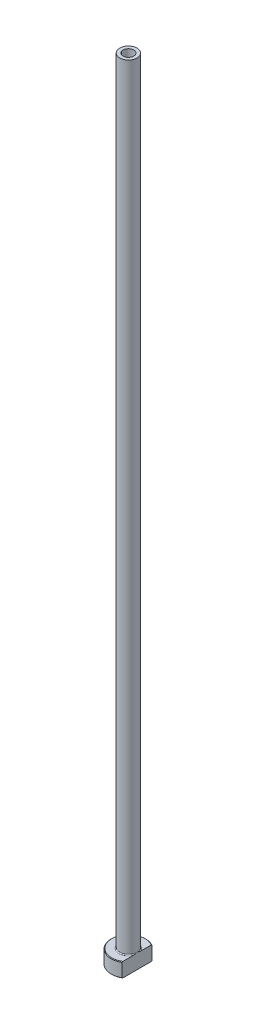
ISO-10303-21;
HEADER;
FILE_DESCRIPTION(('STEP AP214'),'2;1');
FILE_NAME('part.step','',(''),(''),'','','');
FILE_SCHEMA(('AUTOMOTIVE_DESIGN { 1 0 10303 214 1 1 1 1 }'));
ENDSEC;
DATA;
#1=APPLICATION_CONTEXT('core data for automotive mechanical design processes');
#2=APPLICATION_PROTOCOL_DEFINITION('international standard','automotive_design',2000,#1);
#3=PRODUCT_CONTEXT('',#1,'mechanical');
#4=PRODUCT('Part','Part','',(#3));
#5=PRODUCT_RELATED_PRODUCT_CATEGORY('part','',(#4));
#6=PRODUCT_DEFINITION_FORMATION('','',#4);
#7=PRODUCT_DEFINITION_CONTEXT('part definition',#1,'design');
#8=PRODUCT_DEFINITION('design','',#6,#7);
#9=PRODUCT_DEFINITION_SHAPE('','',#8);
#10=(LENGTH_UNIT() NAMED_UNIT(*) SI_UNIT(.MILLI.,.METRE.));
#11=(NAMED_UNIT(*) PLANE_ANGLE_UNIT() SI_UNIT($,.RADIAN.));
#12=(NAMED_UNIT(*) SI_UNIT($,.STERADIAN.) SOLID_ANGLE_UNIT());
#13=UNCERTAINTY_MEASURE_WITH_UNIT(LENGTH_MEASURE(1.E-05),#10,'distance_accuracy_value','');
#14=(GEOMETRIC_REPRESENTATION_CONTEXT(3) GLOBAL_UNCERTAINTY_ASSIGNED_CONTEXT((#13)) GLOBAL_UNIT_ASSIGNED_CONTEXT((#10,
#11,#12)) REPRESENTATION_CONTEXT('',''));
#15=CARTESIAN_POINT('',(0.,0.,0.));
#16=DIRECTION('',(0.,0.,1.));
#17=DIRECTION('',(1.,0.,0.));
#18=AXIS2_PLACEMENT_3D('',#15,#16,#17);
#19=CARTESIAN_POINT('',(0.,92.1876809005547,0.));
#20=DIRECTION('',(0.,1.,0.));
#21=DIRECTION('',(0.,0.,1.));
#22=AXIS2_PLACEMENT_3D('',#19,#20,#21);
#23=CYLINDRICAL_SURFACE('',#22,1.85000000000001);
#24=CARTESIAN_POINT('',(0.,275.,0.));
#25=DIRECTION('',(0.,1.,0.));
#26=DIRECTION('',(0.,0.,1.));
#27=AXIS2_PLACEMENT_3D('',#24,#25,#26);
#28=CIRCLE('',#27,1.85000000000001);
#29=CARTESIAN_POINT('',(0.,275.,1.85000000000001));
#30=VERTEX_POINT('',#29);
#31=EDGE_CURVE('E167',#30,#30,#28,.T.);
#32=ORIENTED_EDGE('',*,*,#31,.T.);
#33=EDGE_LOOP('',(#32));
#34=FACE_BOUND('',#33,.T.);
#35=CARTESIAN_POINT('',(0.,230.,0.));
#36=DIRECTION('',(0.,1.,0.));
#37=DIRECTION('',(0.,0.,1.));
#38=AXIS2_PLACEMENT_3D('',#35,#36,#37);
#39=CIRCLE('',#38,1.85000000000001);
#40=CARTESIAN_POINT('',(0.,230.,1.85000000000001));
#41=VERTEX_POINT('',#40);
#42=EDGE_CURVE('E170',#41,#41,#39,.T.);
#43=ORIENTED_EDGE('',*,*,#42,.F.);
#44=EDGE_LOOP('',(#43));
#45=FACE_BOUND('',#44,.T.);
#46=ADVANCED_FACE('F32',(#34,#45),#23,.F.);
#47=CARTESIAN_POINT('',(-1.85000000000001,275.,0.));
#48=DIRECTION('',(0.,1.,0.));
#49=DIRECTION('',(0.,0.,1.));
#50=AXIS2_PLACEMENT_3D('',#47,#48,#49);
#51=PLANE('',#50);
#52=CARTESIAN_POINT('',(0.,275.,0.));
#53=DIRECTION('',(0.,1.,0.));
#54=DIRECTION('',(0.,0.,1.));
#55=AXIS2_PLACEMENT_3D('',#52,#53,#54);
#56=CIRCLE('',#55,3.00000000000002);
#57=CARTESIAN_POINT('',(0.,275.,3.00000000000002));
#58=VERTEX_POINT('',#57);
#59=EDGE_CURVE('E174',#58,#58,#56,.T.);
#60=ORIENTED_EDGE('',*,*,#59,.T.);
#61=EDGE_LOOP('',(#60));
#62=FACE_BOUND('',#61,.T.);
#63=ORIENTED_EDGE('',*,*,#31,.F.);
#64=EDGE_LOOP('',(#63));
#65=FACE_BOUND('',#64,.T.);
#66=ADVANCED_FACE('F157',(#62,#65),#51,.T.);
#67=CARTESIAN_POINT('',(0.,92.1876809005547,0.));
#68=DIRECTION('',(0.,1.,0.));
#69=DIRECTION('',(0.,0.,1.));
#70=AXIS2_PLACEMENT_3D('',#67,#68,#69);
#71=CYLINDRICAL_SURFACE('',#70,3.00000000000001);
#72=CARTESIAN_POINT('',(0.,5.3,0.));
#73=DIRECTION('',(0.,1.,0.));
#74=DIRECTION('',(0.,0.,1.));
#75=AXIS2_PLACEMENT_3D('',#72,#73,#74);
#76=CIRCLE('',#75,3.00000000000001);
#77=CARTESIAN_POINT('',(3.,5.3,0.));
#78=VERTEX_POINT('',#77);
#79=EDGE_CURVE('E180',#78,#78,#76,.T.);
#80=ORIENTED_EDGE('',*,*,#79,.T.);
#81=EDGE_LOOP('',(#80));
#82=FACE_BOUND('',#81,.T.);
#83=ORIENTED_EDGE('',*,*,#59,.F.);
#84=EDGE_LOOP('',(#83));
#85=FACE_BOUND('',#84,.T.);
#86=ADVANCED_FACE('F162',(#82,#85),#71,.T.);
#87=CARTESIAN_POINT('',(-2.99999999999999,5.,0.));
#88=DIRECTION('',(0.,1.,0.));
#89=DIRECTION('',(0.,0.,1.));
#90=AXIS2_PLACEMENT_3D('',#87,#88,#89);
#91=PLANE('',#90);
#92=DIRECTION('',(0.,0.,1.));
#93=VECTOR('',#92,1.);
#94=CARTESIAN_POINT('',(3.,5.,0.));
#95=LINE('',#94,#93);
#96=CARTESIAN_POINT('',(3.,5.,-4.96386945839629));
#97=VERTEX_POINT('',#96);
#98=CARTESIAN_POINT('',(3.,5.,-1.37477270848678));
#99=VERTEX_POINT('',#98);
#100=EDGE_CURVE('E54',#97,#99,#95,.T.);
#101=ORIENTED_EDGE('',*,*,#100,.F.);
#102=CARTESIAN_POINT('',(0.,5.,0.));
#103=DIRECTION('',(0.,1.,0.));
#104=DIRECTION('',(0.,0.,1.));
#105=AXIS2_PLACEMENT_3D('',#102,#103,#104);
#106=CIRCLE('',#105,5.79999999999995);
#107=CARTESIAN_POINT('',(2.99999999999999,5.,4.96386945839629));
#108=VERTEX_POINT('',#107);
#109=EDGE_CURVE('E186',#97,#108,#106,.T.);
#110=ORIENTED_EDGE('',*,*,#109,.T.);
#111=CARTESIAN_POINT('',(3.,5.,1.37477270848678));
#112=VERTEX_POINT('',#111);
#113=EDGE_CURVE('E134',#112,#108,#95,.T.);
#114=ORIENTED_EDGE('',*,*,#113,.F.);
#115=CARTESIAN_POINT('',(0.,5.,0.));
#116=DIRECTION('',(0.,1.,0.));
#117=DIRECTION('',(0.,0.,1.));
#118=AXIS2_PLACEMENT_3D('',#115,#116,#117);
#119=CIRCLE('',#118,3.30000000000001);
#120=EDGE_CURVE('E183',#112,#99,#119,.F.);
#121=ORIENTED_EDGE('',*,*,#120,.T.);
#122=EDGE_LOOP('',(#101,#110,#114,#121));
#123=FACE_BOUND('',#122,.T.);
#124=ADVANCED_FACE('F197',(#123),#91,.T.);
#125=CARTESIAN_POINT('',(0.,92.1876809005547,0.));
#126=DIRECTION('',(0.,1.,0.));
#127=DIRECTION('',(0.,0.,1.));
#128=AXIS2_PLACEMENT_3D('',#125,#126,#127);
#129=CYLINDRICAL_SURFACE('',#128,5.99999999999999);
#130=DIRECTION('',(0.,-1.,0.));
#131=VECTOR('',#130,1.);
#132=CARTESIAN_POINT('',(2.99999999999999,275.,5.19615242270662));
#133=LINE('',#132,#131);
#134=CARTESIAN_POINT('',(2.99999999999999,4.79999999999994,5.19615242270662));
#135=VERTEX_POINT('',#134);
#136=CARTESIAN_POINT('',(2.99999999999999,0.199999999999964,5.19615242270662));
#137=VERTEX_POINT('',#136);
#138=EDGE_CURVE('E82',#135,#137,#133,.T.);
#139=ORIENTED_EDGE('',*,*,#138,.F.);
#140=CARTESIAN_POINT('',(0.,4.79999999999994,0.));
#141=DIRECTION('',(0.,1.,0.));
#142=DIRECTION('',(0.,0.,1.));
#143=AXIS2_PLACEMENT_3D('',#140,#141,#142);
#144=CIRCLE('',#143,5.99999999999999);
#145=CARTESIAN_POINT('',(3.,4.79999999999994,-5.19615242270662));
#146=VERTEX_POINT('',#145);
#147=EDGE_CURVE('E95',#135,#146,#144,.F.);
#148=ORIENTED_EDGE('',*,*,#147,.T.);
#149=DIRECTION('',(0.,-1.,0.));
#150=VECTOR('',#149,1.);
#151=CARTESIAN_POINT('',(3.,275.,-5.19615242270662));
#152=LINE('',#151,#150);
#153=CARTESIAN_POINT('',(3.,0.199999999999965,-5.19615242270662));
#154=VERTEX_POINT('',#153);
#155=EDGE_CURVE('E192',#146,#154,#152,.T.);
#156=ORIENTED_EDGE('',*,*,#155,.T.);
#157=CARTESIAN_POINT('',(0.,0.199999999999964,0.));
#158=DIRECTION('',(0.,-1.,0.));
#159=DIRECTION('',(0.,0.,-1.));
#160=AXIS2_PLACEMENT_3D('',#157,#158,#159);
#161=CIRCLE('',#160,5.99999999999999);
#162=EDGE_CURVE('E98',#154,#137,#161,.F.);
#163=ORIENTED_EDGE('',*,*,#162,.T.);
#164=EDGE_LOOP('',(#139,#148,#156,#163));
#165=FACE_BOUND('',#164,.T.);
#166=ADVANCED_FACE('F190',(#165),#129,.T.);
#167=CARTESIAN_POINT('',(-5.99999999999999,0.,0.));
#168=DIRECTION('',(0.,-1.,0.));
#169=DIRECTION('',(0.,0.,-1.));
#170=AXIS2_PLACEMENT_3D('',#167,#168,#169);
#171=PLANE('',#170);
#172=CARTESIAN_POINT('',(0.,0.,0.));
#173=DIRECTION('',(0.,-1.,0.));
#174=DIRECTION('',(0.,0.,-1.));
#175=AXIS2_PLACEMENT_3D('',#172,#173,#174);
#176=CIRCLE('',#175,2.60000000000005);
#177=CARTESIAN_POINT('',(0.,0.,-2.60000000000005));
#178=VERTEX_POINT('',#177);
#179=EDGE_CURVE('E40',#178,#178,#176,.F.);
#180=ORIENTED_EDGE('',*,*,#179,.T.);
#181=EDGE_LOOP('',(#180));
#182=FACE_BOUND('',#181,.T.);
#183=DIRECTION('',(0.,0.,-1.));
#184=VECTOR('',#183,1.);
#185=CARTESIAN_POINT('',(2.99999999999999,0.,5.19615242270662));
#186=LINE('',#185,#184);
#187=CARTESIAN_POINT('',(2.99999999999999,0.,4.96386945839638));
#188=VERTEX_POINT('',#187);
#189=CARTESIAN_POINT('',(2.99999999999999,0.,-4.96386945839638));
#190=VERTEX_POINT('',#189);
#191=EDGE_CURVE('E47',#188,#190,#186,.T.);
#192=ORIENTED_EDGE('',*,*,#191,.F.);
#193=CARTESIAN_POINT('',(0.,0.,0.));
#194=DIRECTION('',(0.,-1.,0.));
#195=DIRECTION('',(0.,0.,-1.));
#196=AXIS2_PLACEMENT_3D('',#193,#194,#195);
#197=CIRCLE('',#196,5.80000000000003);
#198=EDGE_CURVE('E92',#188,#190,#197,.T.);
#199=ORIENTED_EDGE('',*,*,#198,.T.);
#200=EDGE_LOOP('',(#192,#199));
#201=FACE_BOUND('',#200,.T.);
#202=ADVANCED_FACE('F91',(#182,#201),#171,.T.);
#203=CARTESIAN_POINT('',(0.,92.1876809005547,0.));
#204=DIRECTION('',(0.,1.,0.));
#205=DIRECTION('',(0.,0.,1.));
#206=AXIS2_PLACEMENT_3D('',#203,#204,#205);
#207=CYLINDRICAL_SURFACE('',#206,2.1);
#208=CARTESIAN_POINT('',(0.,0.500000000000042,0.));
#209=DIRECTION('',(0.,-1.,0.));
#210=DIRECTION('',(0.,0.,-1.));
#211=AXIS2_PLACEMENT_3D('',#208,#209,#210);
#212=CIRCLE('',#211,2.1);
#213=CARTESIAN_POINT('',(0.,0.500000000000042,-2.1));
#214=VERTEX_POINT('',#213);
#215=EDGE_CURVE('E11',#214,#214,#212,.T.);
#216=ORIENTED_EDGE('',*,*,#215,.T.);
#217=EDGE_LOOP('',(#216));
#218=FACE_BOUND('',#217,.T.);
#219=CARTESIAN_POINT('',(0.,218.,0.));
#220=DIRECTION('',(0.,1.,0.));
#221=DIRECTION('',(0.,0.,1.));
#222=AXIS2_PLACEMENT_3D('',#219,#220,#221);
#223=CIRCLE('',#222,2.10000000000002);
#224=CARTESIAN_POINT('',(0.,218.,2.10000000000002));
#225=VERTEX_POINT('',#224);
#226=EDGE_CURVE('E172',#225,#225,#223,.T.);
#227=ORIENTED_EDGE('',*,*,#226,.T.);
#228=EDGE_LOOP('',(#227));
#229=FACE_BOUND('',#228,.T.);
#230=ADVANCED_FACE('F215',(#218,#229),#207,.F.);
#231=CARTESIAN_POINT('',(0.,218.,0.));
#232=DIRECTION('',(0.,-1.,0.));
#233=DIRECTION('',(0.,0.,-1.));
#234=AXIS2_PLACEMENT_3D('',#231,#232,#233);
#235=CONICAL_SURFACE('',#234,2.10000000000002,0.0208303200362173);
#236=ORIENTED_EDGE('',*,*,#42,.T.);
#237=EDGE_LOOP('',(#236));
#238=FACE_BOUND('',#237,.T.);
#239=ORIENTED_EDGE('',*,*,#226,.F.);
#240=EDGE_LOOP('',(#239));
#241=FACE_BOUND('',#240,.T.);
#242=ADVANCED_FACE('F111',(#238,#241),#235,.F.);
#243=CARTESIAN_POINT('',(0.,5.3,0.));
#244=DIRECTION('',(0.,1.,0.));
#245=DIRECTION('',(0.,0.,1.));
#246=AXIS2_PLACEMENT_3D('',#243,#244,#245);
#247=TOROIDAL_SURFACE('',#246,3.30000000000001,0.3);
#248=ORIENTED_EDGE('',*,*,#120,.F.);
#249=CARTESIAN_POINT('',(3.,5.3,0.));
#250=CARTESIAN_POINT('',(3.,5.30000062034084,-1.12611477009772E-10));
#251=CARTESIAN_POINT('',(3.,5.30000124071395,1.79706916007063E-07));
#252=CARTESIAN_POINT('',(3.,5.30000241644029,7.12597808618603E-07));
#253=CARTESIAN_POINT('',(3.,5.30000296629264,1.07470940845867E-06));
#254=CARTESIAN_POINT('',(3.,5.30000408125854,1.93940870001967E-06));
#255=CARTESIAN_POINT('',(3.,5.30000463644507,2.45488669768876E-06));
#256=CARTESIAN_POINT('',(3.,5.30000565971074,3.54465612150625E-06));
#257=CARTESIAN_POINT('',(3.,5.30000612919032,4.11770756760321E-06));
#258=CARTESIAN_POINT('',(3.,5.30000778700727,6.2539657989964E-06));
#259=CARTESIAN_POINT('',(3.,5.30000888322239,7.89071012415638E-06));
#260=CARTESIAN_POINT('',(3.,5.30001076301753,1.11998071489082E-05));
#261=CARTESIAN_POINT('',(3.,5.30001156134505,1.28642129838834E-05));
#262=CARTESIAN_POINT('',(3.,5.30001474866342,1.96537201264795E-05));
#263=CARTESIAN_POINT('',(3.,5.30001702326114,2.48380278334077E-05));
#264=CARTESIAN_POINT('',(3.,5.3000205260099,3.48178528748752E-05));
#265=CARTESIAN_POINT('',(3.,5.30002184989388,3.9580066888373E-05));
#266=CARTESIAN_POINT('',(3.,5.30003122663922,7.41814448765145E-05));
#267=CARTESIAN_POINT('',(3.,5.30003808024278,0.000104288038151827));
#268=CARTESIAN_POINT('',(2.99999999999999,5.30006804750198,0.000222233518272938));
#269=CARTESIAN_POINT('',(2.99999999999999,5.30009687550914,0.000308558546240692));
#270=CARTESIAN_POINT('',(3.,5.30020809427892,0.000648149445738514));
#271=CARTESIAN_POINT('',(3.,5.3002865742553,0.000902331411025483));
#272=CARTESIAN_POINT('',(2.99999999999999,5.30059876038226,0.00190491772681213));
#273=CARTESIAN_POINT('',(2.99999999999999,5.30083723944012,0.00265218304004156));
#274=CARTESIAN_POINT('',(3.,5.30182192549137,0.00574694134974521));
#275=CARTESIAN_POINT('',(3.,5.30256224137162,0.00809584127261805));
#276=CARTESIAN_POINT('',(2.99999999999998,5.31160267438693,0.0367678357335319));
#277=CARTESIAN_POINT('',(2.99999999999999,5.31993817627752,0.0630827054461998));
#278=CARTESIAN_POINT('',(3.,5.33621504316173,0.11470479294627));
#279=CARTESIAN_POINT('',(3.,5.3441590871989,0.140011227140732));
#280=CARTESIAN_POINT('',(2.99999999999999,5.36094382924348,0.193774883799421));
#281=CARTESIAN_POINT('',(2.99999999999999,5.36977415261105,0.222235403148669));
#282=CARTESIAN_POINT('',(3.,5.38736474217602,0.279512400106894));
#283=CARTESIAN_POINT('',(2.99999999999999,5.39612323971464,0.308329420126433));
#284=CARTESIAN_POINT('',(2.99999999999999,5.4172657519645,0.378880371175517));
#285=CARTESIAN_POINT('',(2.99999999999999,5.42952723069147,0.420651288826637));
#286=CARTESIAN_POINT('',(2.99999999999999,5.4530959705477,0.503357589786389));
#287=CARTESIAN_POINT('',(2.99999999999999,5.46441924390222,0.54428839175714));
#288=CARTESIAN_POINT('',(2.99999999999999,5.48778169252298,0.632156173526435));
#289=CARTESIAN_POINT('',(2.99999999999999,5.49969678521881,0.67912648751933));
#290=CARTESIAN_POINT('',(2.99999999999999,5.52221484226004,0.773740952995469));
#291=CARTESIAN_POINT('',(2.99999999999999,5.53280772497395,0.821387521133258));
#292=CARTESIAN_POINT('',(2.99999999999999,5.55291503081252,0.920589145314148));
#293=CARTESIAN_POINT('',(2.99999999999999,5.56229188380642,0.972172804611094));
#294=CARTESIAN_POINT('',(2.99999999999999,5.57838694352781,1.07574836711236));
#295=CARTESIAN_POINT('',(2.99999999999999,5.58510535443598,1.12774023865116));
#296=CARTESIAN_POINT('',(2.99999999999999,5.59681427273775,1.24924411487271));
#297=CARTESIAN_POINT('',(2.99999999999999,5.60051317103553,1.31890364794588));
#298=CARTESIAN_POINT('',(2.99999999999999,5.59966579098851,1.42270835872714));
#299=CARTESIAN_POINT('',(2.99999999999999,5.598358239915,1.45688093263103));
#300=CARTESIAN_POINT('',(2.99999999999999,5.5932274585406,1.52502533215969));
#301=CARTESIAN_POINT('',(2.99999999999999,5.58940645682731,1.55899730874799));
#302=CARTESIAN_POINT('',(2.99999999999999,5.57976146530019,1.61947815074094));
#303=CARTESIAN_POINT('',(2.99999999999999,5.5745150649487,1.64607760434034));
#304=CARTESIAN_POINT('',(2.99999999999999,5.56161153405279,1.69883648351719));
#305=CARTESIAN_POINT('',(2.99999999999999,5.55394338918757,1.72499331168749));
#306=CARTESIAN_POINT('',(2.99999999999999,5.53555176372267,1.77650913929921));
#307=CARTESIAN_POINT('',(2.99999999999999,5.52480031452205,1.80185836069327));
#308=CARTESIAN_POINT('',(2.99999999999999,5.49948027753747,1.85054545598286));
#309=CARTESIAN_POINT('',(2.99999999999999,5.48493141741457,1.87389291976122));
#310=CARTESIAN_POINT('',(2.99999999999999,5.45992470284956,1.90552135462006));
#311=CARTESIAN_POINT('',(2.99999999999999,5.45133318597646,1.91527363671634));
#312=CARTESIAN_POINT('',(2.99999999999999,5.43294163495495,1.93360072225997));
#313=CARTESIAN_POINT('',(2.99999999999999,5.42314083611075,1.94217477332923));
#314=CARTESIAN_POINT('',(2.99999999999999,5.40215892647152,1.95778354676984));
#315=CARTESIAN_POINT('',(2.99999999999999,5.39096156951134,1.96479687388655));
#316=CARTESIAN_POINT('',(2.99999999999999,5.36742144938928,1.97652218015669));
#317=CARTESIAN_POINT('',(2.99999999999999,5.35508207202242,1.98124071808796));
#318=CARTESIAN_POINT('',(2.99999999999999,5.33320117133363,1.98690185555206));
#319=CARTESIAN_POINT('',(2.99999999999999,5.32383559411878,1.9885295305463));
#320=CARTESIAN_POINT('',(2.99999999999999,5.30496375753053,1.99016898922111));
#321=CARTESIAN_POINT('',(2.99999999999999,5.29545756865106,1.99018155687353));
#322=CARTESIAN_POINT('',(2.99999999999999,5.2765931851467,1.98858978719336));
#323=CARTESIAN_POINT('',(2.99999999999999,5.26723486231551,1.98698693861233));
#324=CARTESIAN_POINT('',(2.99999999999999,5.24889957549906,1.98229727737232));
#325=CARTESIAN_POINT('',(2.99999999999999,5.23992286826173,1.97920948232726));
#326=CARTESIAN_POINT('',(2.99999999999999,5.21981293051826,1.97059641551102));
#327=CARTESIAN_POINT('',(2.99999999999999,5.20887713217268,1.96461176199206));
#328=CARTESIAN_POINT('',(2.99999999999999,5.1881153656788,1.95095727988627));
#329=CARTESIAN_POINT('',(2.99999999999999,5.1782917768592,1.94328393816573));
#330=CARTESIAN_POINT('',(2.99999999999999,5.15512177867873,1.92254223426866));
#331=CARTESIAN_POINT('',(2.99999999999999,5.14247568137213,1.90869680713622));
#332=CARTESIAN_POINT('',(2.99999999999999,5.11944595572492,1.87927587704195));
#333=CARTESIAN_POINT('',(2.99999999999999,5.10906527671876,1.8636981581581));
#334=CARTESIAN_POINT('',(2.99999999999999,5.08309609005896,1.81927355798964));
#335=CARTESIAN_POINT('',(2.99999999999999,5.0694854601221,1.78928084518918));
#336=CARTESIAN_POINT('',(2.99999999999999,5.04658664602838,1.72751962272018));
#337=CARTESIAN_POINT('',(2.99999999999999,5.03733582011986,1.69573828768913));
#338=CARTESIAN_POINT('',(2.99999999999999,5.02214318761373,1.63079918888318));
#339=CARTESIAN_POINT('',(2.99999999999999,5.01626537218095,1.5976268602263));
#340=CARTESIAN_POINT('',(2.99999999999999,5.00734002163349,1.53086029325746));
#341=CARTESIAN_POINT('',(2.99999999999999,5.00429797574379,1.49726536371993));
#342=CARTESIAN_POINT('',(2.99999999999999,5.00059037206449,1.4310087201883));
#343=CARTESIAN_POINT('',(2.99999999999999,4.99985343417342,1.39835069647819));
#344=CARTESIAN_POINT('',(2.99999999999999,5.00019322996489,1.33318312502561));
#345=CARTESIAN_POINT('',(2.99999999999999,5.00126261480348,1.30067351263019));
#346=CARTESIAN_POINT('',(2.99999999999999,5.00569854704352,1.22190465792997));
#347=CARTESIAN_POINT('',(2.99999999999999,5.00984986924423,1.17569031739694));
#348=CARTESIAN_POINT('',(2.99999999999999,5.02060876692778,1.08357061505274));
#349=CARTESIAN_POINT('',(2.99999999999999,5.02721586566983,1.03766519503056));
#350=CARTESIAN_POINT('',(2.99999999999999,5.042580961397,0.945130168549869));
#351=CARTESIAN_POINT('',(2.99999999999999,5.0513851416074,0.898508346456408));
#352=CARTESIAN_POINT('',(2.99999999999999,5.0706686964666,0.8054966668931));
#353=CARTESIAN_POINT('',(2.99999999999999,5.0811521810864,0.759107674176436));
#354=CARTESIAN_POINT('',(2.99999999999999,5.10738921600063,0.650207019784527));
#355=CARTESIAN_POINT('',(2.99999999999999,5.12369110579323,0.587828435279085));
#356=CARTESIAN_POINT('',(3.,5.1577768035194,0.464212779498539));
#357=CARTESIAN_POINT('',(3.,5.17554263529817,0.402970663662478));
#358=CARTESIAN_POINT('',(2.99999999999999,5.21006724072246,0.287596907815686));
#359=CARTESIAN_POINT('',(2.99999999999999,5.22671796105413,0.233432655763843));
#360=CARTESIAN_POINT('',(3.,5.25241226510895,0.150940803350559));
#361=CARTESIAN_POINT('',(3.,5.26131063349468,0.122567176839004));
#362=CARTESIAN_POINT('',(2.99999999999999,5.2790517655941,0.0662804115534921));
#363=CARTESIAN_POINT('',(2.99999999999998,5.28789327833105,0.0383669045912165));
#364=CARTESIAN_POINT('',(3.,5.2974387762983,0.00809257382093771));
#365=CARTESIAN_POINT('',(3.,5.29818012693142,0.00574041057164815));
#366=CARTESIAN_POINT('',(2.99999999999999,5.29916506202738,0.00264489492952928));
#367=CARTESIAN_POINT('',(2.99999999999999,5.29940274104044,0.00190013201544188));
#368=CARTESIAN_POINT('',(3.,5.29971394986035,0.000900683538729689));
#369=CARTESIAN_POINT('',(3.,5.29979223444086,0.000647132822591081));
#370=CARTESIAN_POINT('',(2.99999999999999,5.29990321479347,0.000308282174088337));
#371=CARTESIAN_POINT('',(2.99999999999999,5.29993200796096,0.000222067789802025));
#372=CARTESIAN_POINT('',(3.,5.29996194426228,0.000104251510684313));
#373=CARTESIAN_POINT('',(3.,5.29996879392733,7.41614286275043E-05));
#374=CARTESIAN_POINT('',(3.,5.29997816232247,3.95766732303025E-05));
#375=CARTESIAN_POINT('',(3.,5.29997948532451,3.48154693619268E-05));
#376=CARTESIAN_POINT('',(3.,5.29998298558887,2.48376302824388E-05));
#377=CARTESIAN_POINT('',(3.,5.29998525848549,1.96542470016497E-05));
#378=CARTESIAN_POINT('',(3.,5.29998844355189,1.28656664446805E-05));
#379=CARTESIAN_POINT('',(3.,5.29998924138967,1.12013359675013E-05));
#380=CARTESIAN_POINT('',(3.,5.29999112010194,7.89230115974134E-06));
#381=CARTESIAN_POINT('',(3.,5.29999221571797,6.25553603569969E-06));
#382=CARTESIAN_POINT('',(3.,5.29999387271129,4.11914410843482E-06));
#383=CARTESIAN_POINT('',(3.,5.29999434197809,3.54603137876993E-06));
#384=CARTESIAN_POINT('',(3.,5.2999953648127,2.4561010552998E-06));
#385=CARTESIAN_POINT('',(3.,5.29999591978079,1.94052259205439E-06));
#386=CARTESIAN_POINT('',(3.,5.29999703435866,1.07558344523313E-06));
#387=CARTESIAN_POINT('',(3.,5.29999758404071,7.13339615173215E-07));
#388=CARTESIAN_POINT('',(3.,5.2999987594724,1.80122011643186E-07));
#389=CARTESIAN_POINT('',(3.,5.29999937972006,1.12600921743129E-10));
#390=CARTESIAN_POINT('',(3.,5.3,0.));
#391=B_SPLINE_CURVE_WITH_KNOTS('',3,(#249,#250,#251,#252,#253,#254,#255,#256,#257,#258,#259,
#260,#261,#262,#263,#264,#265,#266,#267,#268,#269,#270,#271,#272,#273,#274,#275,#276,#277,#278,
#279,#280,#281,#282,#283,#284,#285,#286,#287,#288,#289,#290,#291,#292,#293,#294,#295,#296,#297,
#298,#299,#300,#301,#302,#303,#304,#305,#306,#307,#308,#309,#310,#311,#312,#313,#314,#315,#316,
#317,#318,#319,#320,#321,#322,#323,#324,#325,#326,#327,#328,#329,#330,#331,#332,#333,#334,#335,
#336,#337,#338,#339,#340,#341,#342,#343,#344,#345,#346,#347,#348,#349,#350,#351,#352,#353,#354,
#355,#356,#357,#358,#359,#360,#361,#362,#363,#364,#365,#366,#367,#368,#369,#370,#371,#372,#373,
#374,#375,#376,#377,#378,#379,#380,#381,#382,#383,#384,#385,#386,#387,#388,#389,#390),
.UNSPECIFIED.,.T.,.F.,(4,2,2,2,2,2,2,2,2,2,2,2,2,2,2,2,2,2,2,2,2,2,2,2,2,2,2,2,2,2,2,2,2,2,2,2,
2,2,2,2,2,2,2,2,2,2,2,2,2,2,2,2,2,2,2,2,2,2,2,2,2,2,2,2,2,2,2,2,2,2,4),(0.,1.86513736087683E-06,
3.83353007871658E-06,6.09512920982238E-06,8.31560138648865E-06,1.4200065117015E-05,
1.97335438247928E-05,3.66769803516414E-05,5.14858238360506E-05,0.000144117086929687,
0.000416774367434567,0.0012152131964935,0.00356794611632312,0.0109568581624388,
0.0937636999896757,0.173336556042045,0.262732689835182,0.353088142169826,0.483684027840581,
0.611082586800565,0.756439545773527,0.902844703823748,1.06007042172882,1.21728406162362,
1.42611662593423,1.52864191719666,1.63107642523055,1.71232857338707,1.79395571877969,
1.87634808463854,1.95832065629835,1.99722769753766,2.03615946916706,2.0755959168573,
2.11491897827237,2.14330913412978,2.17168550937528,2.20003575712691,2.22840478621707,
2.26559554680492,2.30286442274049,2.35880214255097,2.4148122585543,2.51307007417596,
2.61215518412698,2.7130627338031,2.814165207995,2.91210427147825,3.00964583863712,
3.14875779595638,3.28784276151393,3.43014232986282,3.57279564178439,3.76617940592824,
3.9574672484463,4.12746077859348,4.21667041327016,4.30450746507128,4.3119066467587,
4.31425150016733,4.31504795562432,4.31532026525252,4.31541284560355,4.31542765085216,
4.31544458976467,4.31545012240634,4.31545600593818,4.31545822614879,4.31546048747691,
4.31546245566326,4.3154643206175),.UNSPECIFIED.);
#392=EDGE_CURVE('E126',#112,#78,#391,.T.);
#393=ORIENTED_EDGE('',*,*,#392,.T.);
#394=ORIENTED_EDGE('',*,*,#79,.F.);
#395=CARTESIAN_POINT('',(3.,5.3,0.));
#396=CARTESIAN_POINT('',(3.,5.29999937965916,1.12611899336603E-10));
#397=CARTESIAN_POINT('',(3.,5.29999875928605,-1.79706915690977E-07));
#398=CARTESIAN_POINT('',(3.,5.29999758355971,-7.12597808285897E-07));
#399=CARTESIAN_POINT('',(3.,5.29999703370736,-1.07470940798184E-06));
#400=CARTESIAN_POINT('',(3.,5.29999591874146,-1.93940869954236E-06));
#401=CARTESIAN_POINT('',(3.,5.29999536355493,-2.4548866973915E-06));
#402=CARTESIAN_POINT('',(3.,5.29999434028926,-3.54465612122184E-06));
#403=CARTESIAN_POINT('',(3.,5.29999387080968,-4.1177075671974E-06));
#404=CARTESIAN_POINT('',(3.,5.29999221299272,-6.25396579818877E-06));
#405=CARTESIAN_POINT('',(3.,5.2999911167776,-7.89071012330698E-06));
#406=CARTESIAN_POINT('',(3.,5.29998923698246,-1.11998071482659E-05));
#407=CARTESIAN_POINT('',(3.,5.29998843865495,-1.28642129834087E-05));
#408=CARTESIAN_POINT('',(3.,5.29998525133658,-1.96537201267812E-05));
#409=CARTESIAN_POINT('',(3.,5.29998297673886,-2.48380278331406E-05));
#410=CARTESIAN_POINT('',(3.,5.2999794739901,-3.48178528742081E-05));
#411=CARTESIAN_POINT('',(3.,5.29997815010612,-3.95800668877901E-05));
#412=CARTESIAN_POINT('',(3.,5.29996877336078,-7.41814448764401E-05));
#413=CARTESIAN_POINT('',(3.,5.29996191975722,-0.000104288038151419));
#414=CARTESIAN_POINT('',(2.99999999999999,5.29993195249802,-0.000222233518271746));
#415=CARTESIAN_POINT('',(2.99999999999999,5.29990312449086,-0.000308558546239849));
#416=CARTESIAN_POINT('',(3.,5.29979190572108,-0.00064814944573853));
#417=CARTESIAN_POINT('',(3.,5.2997134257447,-0.000902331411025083));
#418=CARTESIAN_POINT('',(2.99999999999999,5.29940123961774,-0.00190491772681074));
#419=CARTESIAN_POINT('',(2.99999999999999,5.29916276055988,-0.00265218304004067));
#420=CARTESIAN_POINT('',(3.,5.29817807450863,-0.00574694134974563));
#421=CARTESIAN_POINT('',(3.,5.29743775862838,-0.00809584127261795));
#422=CARTESIAN_POINT('',(2.99999999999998,5.28839732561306,-0.0367678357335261));
#423=CARTESIAN_POINT('',(2.99999999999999,5.28006182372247,-0.0630827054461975));
#424=CARTESIAN_POINT('',(3.,5.26378495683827,-0.11470479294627));
#425=CARTESIAN_POINT('',(3.,5.2558409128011,-0.140011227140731));
#426=CARTESIAN_POINT('',(2.99999999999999,5.23905617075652,-0.193774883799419));
#427=CARTESIAN_POINT('',(2.99999999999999,5.23022584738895,-0.222235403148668));
#428=CARTESIAN_POINT('',(3.,5.21263525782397,-0.279512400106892));
#429=CARTESIAN_POINT('',(2.99999999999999,5.20387676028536,-0.308329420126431));
#430=CARTESIAN_POINT('',(2.99999999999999,5.1827342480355,-0.378880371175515));
#431=CARTESIAN_POINT('',(2.99999999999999,5.17047276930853,-0.420651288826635));
#432=CARTESIAN_POINT('',(2.99999999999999,5.1469040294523,-0.503357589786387));
#433=CARTESIAN_POINT('',(2.99999999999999,5.13558075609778,-0.544288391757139));
#434=CARTESIAN_POINT('',(2.99999999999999,5.11221830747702,-0.632156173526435));
#435=CARTESIAN_POINT('',(2.99999999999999,5.10030321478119,-0.67912648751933));
#436=CARTESIAN_POINT('',(2.99999999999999,5.07778515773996,-0.773740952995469));
#437=CARTESIAN_POINT('',(2.99999999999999,5.06719227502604,-0.821387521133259));
#438=CARTESIAN_POINT('',(2.99999999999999,5.04708496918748,-0.920589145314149));
#439=CARTESIAN_POINT('',(2.99999999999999,5.03770811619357,-0.972172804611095));
#440=CARTESIAN_POINT('',(2.99999999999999,5.02161305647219,-1.07574836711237));
#441=CARTESIAN_POINT('',(2.99999999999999,5.01489464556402,-1.12774023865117));
#442=CARTESIAN_POINT('',(2.99999999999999,5.00318572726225,-1.24924411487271));
#443=CARTESIAN_POINT('',(2.99999999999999,4.99948682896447,-1.31890364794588));
#444=CARTESIAN_POINT('',(2.99999999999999,5.00033420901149,-1.42270835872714));
#445=CARTESIAN_POINT('',(2.99999999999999,5.001641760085,-1.45688093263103));
#446=CARTESIAN_POINT('',(2.99999999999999,5.0067725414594,-1.52502533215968));
#447=CARTESIAN_POINT('',(2.99999999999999,5.01059354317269,-1.55899730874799));
#448=CARTESIAN_POINT('',(2.99999999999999,5.02023853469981,-1.61947815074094));
#449=CARTESIAN_POINT('',(2.99999999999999,5.0254849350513,-1.64607760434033));
#450=CARTESIAN_POINT('',(2.99999999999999,5.03838846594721,-1.69883648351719));
#451=CARTESIAN_POINT('',(2.99999999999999,5.04605661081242,-1.72499331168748));
#452=CARTESIAN_POINT('',(2.99999999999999,5.06444823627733,-1.77650913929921));
#453=CARTESIAN_POINT('',(2.99999999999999,5.07519968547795,-1.80185836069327));
#454=CARTESIAN_POINT('',(2.99999999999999,5.10051972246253,-1.85054545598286));
#455=CARTESIAN_POINT('',(2.99999999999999,5.11506858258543,-1.87389291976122));
#456=CARTESIAN_POINT('',(2.99999999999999,5.14007529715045,-1.90552135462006));
#457=CARTESIAN_POINT('',(2.99999999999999,5.14866681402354,-1.91527363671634));
#458=CARTESIAN_POINT('',(2.99999999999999,5.16705836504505,-1.93360072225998));
#459=CARTESIAN_POINT('',(2.99999999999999,5.17685916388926,-1.94217477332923));
#460=CARTESIAN_POINT('',(2.99999999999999,5.19784107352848,-1.95778354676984));
#461=CARTESIAN_POINT('',(2.99999999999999,5.20903843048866,-1.96479687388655));
#462=CARTESIAN_POINT('',(2.99999999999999,5.23257855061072,-1.97652218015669));
#463=CARTESIAN_POINT('',(2.99999999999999,5.24491792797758,-1.98124071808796));
#464=CARTESIAN_POINT('',(2.99999999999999,5.26679882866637,-1.98690185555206));
#465=CARTESIAN_POINT('',(2.99999999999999,5.27616440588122,-1.9885295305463));
#466=CARTESIAN_POINT('',(2.99999999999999,5.29503624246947,-1.99016898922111));
#467=CARTESIAN_POINT('',(2.99999999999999,5.30454243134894,-1.99018155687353));
#468=CARTESIAN_POINT('',(2.99999999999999,5.3234068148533,-1.98858978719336));
#469=CARTESIAN_POINT('',(2.99999999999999,5.33276513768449,-1.98698693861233));
#470=CARTESIAN_POINT('',(2.99999999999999,5.35110042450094,-1.98229727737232));
#471=CARTESIAN_POINT('',(2.99999999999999,5.36007713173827,-1.97920948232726));
#472=CARTESIAN_POINT('',(2.99999999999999,5.38018706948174,-1.97059641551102));
#473=CARTESIAN_POINT('',(2.99999999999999,5.39112286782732,-1.96461176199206));
#474=CARTESIAN_POINT('',(2.99999999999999,5.4118846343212,-1.95095727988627));
#475=CARTESIAN_POINT('',(2.99999999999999,5.4217082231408,-1.94328393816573));
#476=CARTESIAN_POINT('',(2.99999999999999,5.44487822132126,-1.92254223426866));
#477=CARTESIAN_POINT('',(2.99999999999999,5.45752431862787,-1.90869680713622));
#478=CARTESIAN_POINT('',(2.99999999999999,5.48055404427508,-1.87927587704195));
#479=CARTESIAN_POINT('',(2.99999999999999,5.49093472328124,-1.8636981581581));
#480=CARTESIAN_POINT('',(2.99999999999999,5.51690390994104,-1.81927355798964));
#481=CARTESIAN_POINT('',(2.99999999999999,5.5305145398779,-1.78928084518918));
#482=CARTESIAN_POINT('',(2.99999999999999,5.55341335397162,-1.72751962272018));
#483=CARTESIAN_POINT('',(2.99999999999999,5.56266417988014,-1.69573828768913));
#484=CARTESIAN_POINT('',(2.99999999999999,5.57785681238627,-1.63079918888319));
#485=CARTESIAN_POINT('',(2.99999999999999,5.58373462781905,-1.59762686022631));
#486=CARTESIAN_POINT('',(2.99999999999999,5.59265997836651,-1.53086029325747));
#487=CARTESIAN_POINT('',(2.99999999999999,5.59570202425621,-1.49726536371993));
#488=CARTESIAN_POINT('',(2.99999999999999,5.59940962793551,-1.4310087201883));
#489=CARTESIAN_POINT('',(2.99999999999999,5.60014656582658,-1.3983506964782));
#490=CARTESIAN_POINT('',(2.99999999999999,5.5998067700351,-1.33318312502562));
#491=CARTESIAN_POINT('',(2.99999999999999,5.59873738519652,-1.3006735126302));
#492=CARTESIAN_POINT('',(2.99999999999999,5.59430145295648,-1.22190465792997));
#493=CARTESIAN_POINT('',(2.99999999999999,5.59015013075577,-1.17569031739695));
#494=CARTESIAN_POINT('',(2.99999999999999,5.57939123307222,-1.08357061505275));
#495=CARTESIAN_POINT('',(2.99999999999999,5.57278413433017,-1.03766519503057));
#496=CARTESIAN_POINT('',(2.99999999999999,5.557419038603,-0.945130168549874));
#497=CARTESIAN_POINT('',(2.99999999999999,5.5486148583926,-0.898508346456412));
#498=CARTESIAN_POINT('',(2.99999999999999,5.5293313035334,-0.805496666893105));
#499=CARTESIAN_POINT('',(2.99999999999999,5.5188478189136,-0.759107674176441));
#500=CARTESIAN_POINT('',(2.99999999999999,5.49261078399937,-0.650207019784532));
#501=CARTESIAN_POINT('',(2.99999999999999,5.47630889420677,-0.58782843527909));
#502=CARTESIAN_POINT('',(3.,5.4422231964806,-0.464212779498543));
#503=CARTESIAN_POINT('',(3.,5.42445736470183,-0.402970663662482));
#504=CARTESIAN_POINT('',(2.99999999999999,5.38993275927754,-0.287596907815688));
#505=CARTESIAN_POINT('',(2.99999999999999,5.37328203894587,-0.233432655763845));
#506=CARTESIAN_POINT('',(3.,5.34758773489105,-0.15094080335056));
#507=CARTESIAN_POINT('',(3.,5.33868936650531,-0.122567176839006));
#508=CARTESIAN_POINT('',(2.99999999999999,5.3209482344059,-0.0662804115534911));
#509=CARTESIAN_POINT('',(2.99999999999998,5.31210672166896,-0.0383669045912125));
#510=CARTESIAN_POINT('',(3.,5.3025612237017,-0.00809257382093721));
#511=CARTESIAN_POINT('',(3.,5.30181987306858,-0.00574041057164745));
#512=CARTESIAN_POINT('',(2.99999999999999,5.30083493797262,-0.00264489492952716));
#513=CARTESIAN_POINT('',(2.99999999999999,5.30059725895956,-0.00190013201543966));
#514=CARTESIAN_POINT('',(3.,5.30028605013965,-0.000900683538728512));
#515=CARTESIAN_POINT('',(3.,5.30020776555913,-0.000647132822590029));
#516=CARTESIAN_POINT('',(2.99999999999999,5.30009678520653,-0.000308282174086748));
#517=CARTESIAN_POINT('',(2.99999999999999,5.30006799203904,-0.000222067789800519));
#518=CARTESIAN_POINT('',(3.,5.30003805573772,-0.000104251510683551));
#519=CARTESIAN_POINT('',(3.,5.30003120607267,-7.4161428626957E-05));
#520=CARTESIAN_POINT('',(3.,5.30002183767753,-3.95766732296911E-05));
#521=CARTESIAN_POINT('',(3.,5.30002051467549,-3.48154693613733E-05));
#522=CARTESIAN_POINT('',(3.,5.30001701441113,-2.48376302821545E-05));
#523=CARTESIAN_POINT('',(3.,5.3000147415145,-1.96542470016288E-05));
#524=CARTESIAN_POINT('',(3.,5.30001155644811,-1.28656664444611E-05));
#525=CARTESIAN_POINT('',(3.,5.30001075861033,-1.12013359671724E-05));
#526=CARTESIAN_POINT('',(3.,5.30000887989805,-7.89230115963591E-06));
#527=CARTESIAN_POINT('',(3.,5.30000778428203,-6.25553603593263E-06));
#528=CARTESIAN_POINT('',(3.,5.30000612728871,-4.11914410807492E-06));
#529=CARTESIAN_POINT('',(3.,5.30000565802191,-3.54603137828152E-06));
#530=CARTESIAN_POINT('',(3.,5.3000046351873,-2.45610105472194E-06));
#531=CARTESIAN_POINT('',(3.,5.30000408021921,-1.94052259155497E-06));
#532=CARTESIAN_POINT('',(3.,5.30000296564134,-1.07558344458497E-06));
#533=CARTESIAN_POINT('',(3.,5.30000241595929,-7.13339614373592E-07));
#534=CARTESIAN_POINT('',(3.,5.3000012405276,-1.80122010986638E-07));
#535=CARTESIAN_POINT('',(3.,5.30000062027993,-1.12600342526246E-10));
#536=CARTESIAN_POINT('',(3.,5.3,0.));
#537=B_SPLINE_CURVE_WITH_KNOTS('',3,(#395,#396,#397,#398,#399,#400,#401,#402,#403,#404,#405,
#406,#407,#408,#409,#410,#411,#412,#413,#414,#415,#416,#417,#418,#419,#420,#421,#422,#423,#424,
#425,#426,#427,#428,#429,#430,#431,#432,#433,#434,#435,#436,#437,#438,#439,#440,#441,#442,#443,
#444,#445,#446,#447,#448,#449,#450,#451,#452,#453,#454,#455,#456,#457,#458,#459,#460,#461,#462,
#463,#464,#465,#466,#467,#468,#469,#470,#471,#472,#473,#474,#475,#476,#477,#478,#479,#480,#481,
#482,#483,#484,#485,#486,#487,#488,#489,#490,#491,#492,#493,#494,#495,#496,#497,#498,#499,#500,
#501,#502,#503,#504,#505,#506,#507,#508,#509,#510,#511,#512,#513,#514,#515,#516,#517,#518,#519,
#520,#521,#522,#523,#524,#525,#526,#527,#528,#529,#530,#531,#532,#533,#534,#535,#536),
.UNSPECIFIED.,.T.,.F.,(4,2,2,2,2,2,2,2,2,2,2,2,2,2,2,2,2,2,2,2,2,2,2,2,2,2,2,2,2,2,2,2,2,2,2,2,
2,2,2,2,2,2,2,2,2,2,2,2,2,2,2,2,2,2,2,2,2,2,2,2,2,2,2,2,2,2,2,2,2,2,4),(0.,1.86513736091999E-06,
3.83353007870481E-06,6.09512920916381E-06,8.31560138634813E-06,1.42000651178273E-05,
1.97335438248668E-05,3.66769803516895E-05,5.14858238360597E-05,0.000144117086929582,
0.000416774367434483,0.00121521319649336,0.0035679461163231,0.0109568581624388,
0.0937636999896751,0.173336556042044,0.262732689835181,0.353088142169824,0.48368402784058,
0.611082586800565,0.756439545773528,0.902844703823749,1.06007042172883,1.21728406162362,
1.42611662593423,1.52864191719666,1.63107642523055,1.71232857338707,1.79395571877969,
1.87634808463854,1.95832065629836,1.99722769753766,2.03615946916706,2.0755959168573,
2.11491897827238,2.14330913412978,2.17168550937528,2.20003575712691,2.22840478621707,
2.26559554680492,2.30286442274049,2.35880214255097,2.4148122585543,2.51307007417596,
2.61215518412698,2.7130627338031,2.814165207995,2.91210427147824,3.00964583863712,
3.14875779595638,3.28784276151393,3.43014232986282,3.57279564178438,3.76617940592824,
3.9574672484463,4.12746077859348,4.21667041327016,4.30450746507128,4.3119066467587,
4.31425150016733,4.31504795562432,4.31532026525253,4.31541284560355,4.31542765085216,
4.31544458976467,4.31545012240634,4.31545600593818,4.31545822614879,4.31546048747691,
4.31546245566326,4.3154643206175),.UNSPECIFIED.);
#538=EDGE_CURVE('E135',#78,#99,#537,.T.);
#539=ORIENTED_EDGE('',*,*,#538,.T.);
#540=EDGE_LOOP('',(#248,#393,#394,#539));
#541=FACE_BOUND('',#540,.T.);
#542=ADVANCED_FACE('F141',(#541),#247,.F.);
#543=CARTESIAN_POINT('',(0.,5.,0.));
#544=DIRECTION('',(0.,-1.,0.));
#545=DIRECTION('',(0.,0.,-1.));
#546=AXIS2_PLACEMENT_3D('',#543,#544,#545);
#547=CONICAL_SURFACE('',#546,5.79999999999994,0.785398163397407);
#548=CARTESIAN_POINT('',(3.,-1.01993959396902,-11.432889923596));
#549=CARTESIAN_POINT('',(3.,-0.769424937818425,-11.1738796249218));
#550=CARTESIAN_POINT('',(3.,-0.519179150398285,-10.9146084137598));
#551=CARTESIAN_POINT('',(3.,-0.0193842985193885,-10.3953890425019));
#552=CARTESIAN_POINT('',(3.,0.23016475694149,-10.1354408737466));
#553=CARTESIAN_POINT('',(3.,0.728528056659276,-9.61458602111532));
#554=CARTESIAN_POINT('',(3.,0.977341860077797,-9.353678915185));
#555=CARTESIAN_POINT('',(3.,1.47386965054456,-8.83082274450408));
#556=CARTESIAN_POINT('',(3.,1.7215836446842,-8.56887368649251));
#557=CARTESIAN_POINT('',(3.,2.21069282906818,-8.04884148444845));
#558=CARTESIAN_POINT('',(3.,2.45211594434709,-7.79078462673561));
#559=CARTESIAN_POINT('',(3.,2.93315589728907,-7.2729934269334));
#560=CARTESIAN_POINT('',(3.,3.17277274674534,-7.01325909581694));
#561=CARTESIAN_POINT('',(3.,3.64950020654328,-6.49159990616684));
#562=CARTESIAN_POINT('',(3.,3.88661134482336,-6.22967553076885));
#563=CARTESIAN_POINT('',(3.,4.35738571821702,-5.70275148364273));
#564=CARTESIAN_POINT('',(3.,4.59104909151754,-5.43775193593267));
#565=CARTESIAN_POINT('',(3.,4.96416348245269,-5.00636825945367));
#566=CARTESIAN_POINT('',(3.,5.10520133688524,-4.84135845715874));
#567=CARTESIAN_POINT('',(3.,5.3847667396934,-4.50919282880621));
#568=CARTESIAN_POINT('',(3.,5.52329404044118,-4.34203679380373));
#569=CARTESIAN_POINT('',(3.,5.79842961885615,-4.00319933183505));
#570=CARTESIAN_POINT('',(3.,5.93500216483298,-3.83148875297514));
#571=CARTESIAN_POINT('',(3.,6.20336281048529,-3.4844211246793));
#572=CARTESIAN_POINT('',(3.,6.33515205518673,-3.30906496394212));
#573=CARTESIAN_POINT('',(3.,6.59393382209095,-2.95070802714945));
#574=CARTESIAN_POINT('',(2.99999999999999,6.72082315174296,-2.76763161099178));
#575=CARTESIAN_POINT('',(2.99999999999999,6.90336321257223,-2.48771743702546));
#576=CARTESIAN_POINT('',(2.99999999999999,6.96295431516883,-2.3934539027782));
#577=CARTESIAN_POINT('',(2.99999999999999,7.07882720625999,-2.20292146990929));
#578=CARTESIAN_POINT('',(2.99999999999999,7.13510937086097,-2.10665280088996));
#579=CARTESIAN_POINT('',(2.99999999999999,7.24288059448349,-1.91297779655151));
#580=CARTESIAN_POINT('',(2.99999999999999,7.29441986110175,-1.81559978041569));
#581=CARTESIAN_POINT('',(2.99999999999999,7.39241237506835,-1.61833215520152));
#582=CARTESIAN_POINT('',(2.99999999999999,7.43886469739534,-1.51844209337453));
#583=CARTESIAN_POINT('',(2.99999999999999,7.56840030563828,-1.21511948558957));
#584=CARTESIAN_POINT('',(2.99999999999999,7.64209011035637,-1.00730397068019));
#585=CARTESIAN_POINT('',(2.99999999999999,7.72186700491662,-0.695731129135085));
#586=CARTESIAN_POINT('',(2.99999999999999,7.74302901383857,-0.595791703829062));
#587=CARTESIAN_POINT('',(2.99999999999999,7.775825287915,-0.394325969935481));
#588=CARTESIAN_POINT('',(2.99999999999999,7.78746040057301,-0.292799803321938));
#589=CARTESIAN_POINT('',(2.99999999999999,7.80037895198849,-0.0893987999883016));
#590=CARTESIAN_POINT('',(2.99999999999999,7.80169449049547,0.0124739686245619));
#591=CARTESIAN_POINT('',(2.99999999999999,7.79396363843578,0.215826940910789));
#592=CARTESIAN_POINT('',(2.99999999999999,7.78491639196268,0.317307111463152));
#593=CARTESIAN_POINT('',(2.99999999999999,7.75721241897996,0.518039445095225));
#594=CARTESIAN_POINT('',(2.99999999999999,7.73863812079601,0.617303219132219));
#595=CARTESIAN_POINT('',(2.99999999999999,7.69303955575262,0.813850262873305));
#596=CARTESIAN_POINT('',(2.99999999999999,7.6660142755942,0.911133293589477));
#597=CARTESIAN_POINT('',(2.99999999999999,7.60464499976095,1.10394843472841));
#598=CARTESIAN_POINT('',(2.99999999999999,7.57025976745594,1.19946724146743));
#599=CARTESIAN_POINT('',(2.99999999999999,7.49555762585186,1.38810736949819));
#600=CARTESIAN_POINT('',(2.99999999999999,7.45524192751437,1.48122917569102));
#601=CARTESIAN_POINT('',(2.99999999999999,7.36961028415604,1.66561491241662));
#602=CARTESIAN_POINT('',(2.99999999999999,7.32427350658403,1.75686908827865));
#603=CARTESIAN_POINT('',(2.99999999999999,7.2296607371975,1.93732130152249));
#604=CARTESIAN_POINT('',(2.99999999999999,7.18038388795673,2.02651888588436));
#605=CARTESIAN_POINT('',(2.99999999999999,7.02771106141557,2.29153460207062));
#606=CARTESIAN_POINT('',(2.99999999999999,6.91955486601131,2.4646062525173));
#607=CARTESIAN_POINT('',(2.99999999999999,6.69440299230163,2.80577028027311));
#608=CARTESIAN_POINT('',(2.99999999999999,6.57737415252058,2.97384034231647));
#609=CARTESIAN_POINT('',(2.99999999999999,6.33748949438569,3.30561771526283));
#610=CARTESIAN_POINT('',(2.99999999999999,6.21463662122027,3.46932716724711));
#611=CARTESIAN_POINT('',(2.99999999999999,5.96308085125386,3.79561670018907));
#612=CARTESIAN_POINT('',(2.99999999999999,5.83432224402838,3.95815356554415));
#613=CARTESIAN_POINT('',(2.99999999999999,5.57361365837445,4.28066737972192));
#614=CARTESIAN_POINT('',(2.99999999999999,5.44166333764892,4.44064405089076));
#615=CARTESIAN_POINT('',(2.99999999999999,5.17568445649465,4.75819552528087));
#616=CARTESIAN_POINT('',(2.99999999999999,5.0416617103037,4.91577521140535));
#617=CARTESIAN_POINT('',(2.99999999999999,4.77176230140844,5.22934053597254));
#618=CARTESIAN_POINT('',(2.99999999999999,4.63588560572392,5.38532614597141));
#619=CARTESIAN_POINT('',(2.99999999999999,4.27256222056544,5.79849838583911));
#620=CARTESIAN_POINT('',(2.99999999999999,4.04384014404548,6.05456265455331));
#621=CARTESIAN_POINT('',(2.99999999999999,3.5836002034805,6.5641703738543));
#622=CARTESIAN_POINT('',(2.99999999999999,3.35208226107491,6.81771375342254));
#623=CARTESIAN_POINT('',(2.99999999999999,2.88678846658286,7.32315936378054));
#624=CARTESIAN_POINT('',(2.99999999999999,2.65301069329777,7.57505982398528));
#625=CARTESIAN_POINT('',(2.99999999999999,2.18392232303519,8.07742926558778));
#626=CARTESIAN_POINT('',(2.99999999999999,1.94861172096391,8.32789824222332));
#627=CARTESIAN_POINT('',(2.99999999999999,1.48651581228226,8.81743943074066));
#628=CARTESIAN_POINT('',(2.99999999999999,1.25977806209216,9.05655656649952));
#629=CARTESIAN_POINT('',(2.99999999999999,0.805439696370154,9.53397105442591));
#630=CARTESIAN_POINT('',(2.99999999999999,0.577839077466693,9.77226840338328));
#631=CARTESIAN_POINT('',(2.99999999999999,0.122198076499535,10.2479325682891));
#632=CARTESIAN_POINT('',(2.99999999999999,-0.105841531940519,10.4853001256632));
#633=CARTESIAN_POINT('',(2.99999999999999,-0.562491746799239,10.9594816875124));
#634=CARTESIAN_POINT('',(2.99999999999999,-0.791102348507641,11.1962956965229));
#635=CARTESIAN_POINT('',(2.99999999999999,-1.01993959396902,11.432889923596));
#636=B_SPLINE_CURVE_WITH_KNOTS('',3,(#548,#549,#550,#551,#552,#553,#554,#555,#556,#557,#558,
#559,#560,#561,#562,#563,#564,#565,#566,#567,#568,#569,#570,#571,#572,#573,#574,#575,#576,#577,
#578,#579,#580,#581,#582,#583,#584,#585,#586,#587,#588,#589,#590,#591,#592,#593,#594,#595,#596,
#597,#598,#599,#600,#601,#602,#603,#604,#605,#606,#607,#608,#609,#610,#611,#612,#613,#614,#615,
#616,#617,#618,#619,#620,#621,#622,#623,#624,#625,#626,#627,#628,#629,#630,#631,#632,#633,#634,
#635),.UNSPECIFIED.,.F.,.F.,(4,2,2,2,2,2,2,2,2,2,2,2,2,2,2,2,2,2,2,2,2,2,2,2,2,2,2,2,2,2,2,2,2,
2,2,2,2,2,2,2,2,2,2,4),(0.,1.08101662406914,2.16204714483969,3.24363027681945,4.32520642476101,
5.38534462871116,6.445475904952,7.50537917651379,8.5652398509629,9.21643479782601,
9.86769362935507,10.52583232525,11.183812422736,11.8517813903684,12.1862877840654,
12.5207560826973,12.85113322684,13.1815703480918,13.839916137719,14.1460077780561,
14.452072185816,14.7571841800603,15.0623213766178,15.3648619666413,15.6674388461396,
15.971757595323,16.2760142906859,16.5815843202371,16.88722102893,17.4990577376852,
18.1133060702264,18.7272470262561,19.3492675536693,19.971355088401,20.5919343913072,
21.212524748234,22.2425132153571,23.2725306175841,24.3035181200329,25.3345090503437,
26.3230827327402,27.31166028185,28.2991352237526,29.286602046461),.UNSPECIFIED.);
#637=EDGE_CURVE('E133',#146,#97,#636,.T.);
#638=ORIENTED_EDGE('',*,*,#637,.F.);
#639=ORIENTED_EDGE('',*,*,#147,.F.);
#640=EDGE_CURVE('E118',#108,#135,#636,.T.);
#641=ORIENTED_EDGE('',*,*,#640,.F.);
#642=ORIENTED_EDGE('',*,*,#109,.F.);
#643=EDGE_LOOP('',(#638,#639,#641,#642));
#644=FACE_BOUND('',#643,.T.);
#645=ADVANCED_FACE('F145',(#644),#547,.T.);
#646=CARTESIAN_POINT('',(0.,0.199999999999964,0.));
#647=DIRECTION('',(0.,1.,0.));
#648=DIRECTION('',(0.,0.,1.));
#649=AXIS2_PLACEMENT_3D('',#646,#647,#648);
#650=CONICAL_SURFACE('',#649,5.99999999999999,0.78539816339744);
#651=CARTESIAN_POINT('',(2.99999999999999,6.01993959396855,11.432889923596));
#652=CARTESIAN_POINT('',(2.99999999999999,5.76942493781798,11.1738796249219));
#653=CARTESIAN_POINT('',(2.99999999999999,5.51917915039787,10.9146084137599));
#654=CARTESIAN_POINT('',(2.99999999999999,5.01938429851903,10.395389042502));
#655=CARTESIAN_POINT('',(2.99999999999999,4.76983524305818,10.1354408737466));
#656=CARTESIAN_POINT('',(2.99999999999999,4.27147194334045,9.61458602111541));
#657=CARTESIAN_POINT('',(2.99999999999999,4.02265813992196,9.3536789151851));
#658=CARTESIAN_POINT('',(2.99999999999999,3.52613034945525,8.8308227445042));
#659=CARTESIAN_POINT('',(2.99999999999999,3.27841635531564,8.56887368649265));
#660=CARTESIAN_POINT('',(2.99999999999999,2.78930717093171,8.04884148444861));
#661=CARTESIAN_POINT('',(2.99999999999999,2.54788405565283,7.79078462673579));
#662=CARTESIAN_POINT('',(2.99999999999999,2.0668441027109,7.2729934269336));
#663=CARTESIAN_POINT('',(2.99999999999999,1.82722725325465,7.01325909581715));
#664=CARTESIAN_POINT('',(2.99999999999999,1.35049979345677,6.49159990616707));
#665=CARTESIAN_POINT('',(2.99999999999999,1.1133886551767,6.22967553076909));
#666=CARTESIAN_POINT('',(2.99999999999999,0.642614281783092,5.702751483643));
#667=CARTESIAN_POINT('',(2.99999999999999,0.408950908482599,5.43775193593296));
#668=CARTESIAN_POINT('',(2.99999999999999,0.0358365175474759,5.00636825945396));
#669=CARTESIAN_POINT('',(2.99999999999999,-0.105201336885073,4.84135845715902));
#670=CARTESIAN_POINT('',(2.99999999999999,-0.384766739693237,4.50919282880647));
#671=CARTESIAN_POINT('',(2.99999999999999,-0.523294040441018,4.34203679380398));
#672=CARTESIAN_POINT('',(2.99999999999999,-0.798429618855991,4.00319933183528));
#673=CARTESIAN_POINT('',(2.99999999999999,-0.935002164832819,3.83148875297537));
#674=CARTESIAN_POINT('',(2.99999999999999,-1.20336281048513,3.48442112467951));
#675=CARTESIAN_POINT('',(2.99999999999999,-1.33515205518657,3.30906496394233));
#676=CARTESIAN_POINT('',(2.99999999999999,-1.5939338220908,2.95070802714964));
#677=CARTESIAN_POINT('',(2.99999999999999,-1.7208231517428,2.76763161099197));
#678=CARTESIAN_POINT('',(2.99999999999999,-1.90336321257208,2.48771743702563));
#679=CARTESIAN_POINT('',(2.99999999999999,-1.96295431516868,2.39345390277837));
#680=CARTESIAN_POINT('',(2.99999999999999,-2.07882720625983,2.20292146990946));
#681=CARTESIAN_POINT('',(2.99999999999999,-2.13510937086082,2.10665280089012));
#682=CARTESIAN_POINT('',(2.99999999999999,-2.24288059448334,1.91297779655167));
#683=CARTESIAN_POINT('',(2.99999999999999,-2.2944198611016,1.81559978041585));
#684=CARTESIAN_POINT('',(2.99999999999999,-2.3924123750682,1.61833215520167));
#685=CARTESIAN_POINT('',(2.99999999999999,-2.4388646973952,1.51844209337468));
#686=CARTESIAN_POINT('',(2.99999999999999,-2.56840030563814,1.2151194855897));
#687=CARTESIAN_POINT('',(2.99999999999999,-2.64209011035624,1.00730397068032));
#688=CARTESIAN_POINT('',(2.99999999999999,-2.7218670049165,0.695731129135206));
#689=CARTESIAN_POINT('',(2.99999999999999,-2.74302901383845,0.595791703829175));
#690=CARTESIAN_POINT('',(2.99999999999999,-2.77582528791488,0.394325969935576));
#691=CARTESIAN_POINT('',(2.99999999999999,-2.7874604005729,0.292799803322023));
#692=CARTESIAN_POINT('',(2.99999999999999,-2.80037895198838,0.089398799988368));
#693=CARTESIAN_POINT('',(2.99999999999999,-2.80169449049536,-0.0124739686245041));
#694=CARTESIAN_POINT('',(2.99999999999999,-2.79396363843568,-0.21582694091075));
#695=CARTESIAN_POINT('',(2.99999999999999,-2.78491639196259,-0.317307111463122));
#696=CARTESIAN_POINT('',(2.99999999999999,-2.75721241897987,-0.518039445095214));
#697=CARTESIAN_POINT('',(2.99999999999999,-2.73863812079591,-0.617303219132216));
#698=CARTESIAN_POINT('',(2.99999999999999,-2.69303955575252,-0.813850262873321));
#699=CARTESIAN_POINT('',(2.99999999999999,-2.6660142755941,-0.911133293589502));
#700=CARTESIAN_POINT('',(2.99999999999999,-2.60464499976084,-1.10394843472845));
#701=CARTESIAN_POINT('',(2.99999999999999,-2.57025976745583,-1.19946724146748));
#702=CARTESIAN_POINT('',(2.99999999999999,-2.49555762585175,-1.38810736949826));
#703=CARTESIAN_POINT('',(2.99999999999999,-2.45524192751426,-1.4812291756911));
#704=CARTESIAN_POINT('',(2.99999999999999,-2.36961028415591,-1.66561491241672));
#705=CARTESIAN_POINT('',(2.99999999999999,-2.3242735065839,-1.75686908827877));
#706=CARTESIAN_POINT('',(2.99999999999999,-2.22966073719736,-1.93732130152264));
#707=CARTESIAN_POINT('',(2.99999999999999,-2.18038388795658,-2.02651888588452));
#708=CARTESIAN_POINT('',(2.99999999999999,-2.02771106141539,-2.29153460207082));
#709=CARTESIAN_POINT('',(3.,-1.91955486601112,-2.46460625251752));
#710=CARTESIAN_POINT('',(3.,-1.69440299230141,-2.80577028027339));
#711=CARTESIAN_POINT('',(3.,-1.57737415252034,-2.97384034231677));
#712=CARTESIAN_POINT('',(3.,-1.33748949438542,-3.30561771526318));
#713=CARTESIAN_POINT('',(3.,-1.21463662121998,-3.46932716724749));
#714=CARTESIAN_POINT('',(3.,-0.963080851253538,-3.79561670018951));
#715=CARTESIAN_POINT('',(3.,-0.834322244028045,-3.95815356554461));
#716=CARTESIAN_POINT('',(3.,-0.573613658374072,-4.28066737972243));
#717=CARTESIAN_POINT('',(3.,-0.44166333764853,-4.44064405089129));
#718=CARTESIAN_POINT('',(3.,-0.175684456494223,-4.75819552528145));
#719=CARTESIAN_POINT('',(3.,-0.0416617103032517,-4.91577521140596));
#720=CARTESIAN_POINT('',(3.,0.228237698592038,-5.22934053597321));
#721=CARTESIAN_POINT('',(3.,0.364114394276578,-5.38532614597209));
#722=CARTESIAN_POINT('',(3.,0.727437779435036,-5.79849838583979));
#723=CARTESIAN_POINT('',(3.,0.956159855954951,-6.05456265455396));
#724=CARTESIAN_POINT('',(3.,1.41639979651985,-6.56417037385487));
#725=CARTESIAN_POINT('',(3.,1.6479177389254,-6.81771375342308));
#726=CARTESIAN_POINT('',(3.,2.11321153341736,-7.32315936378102));
#727=CARTESIAN_POINT('',(3.,2.34698930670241,-7.57505982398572));
#728=CARTESIAN_POINT('',(3.,2.8160776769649,-8.07742926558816));
#729=CARTESIAN_POINT('',(3.,3.05138827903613,-8.32789824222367));
#730=CARTESIAN_POINT('',(3.,3.51348418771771,-8.81743943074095));
#731=CARTESIAN_POINT('',(3.,3.74022193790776,-9.05655656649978));
#732=CARTESIAN_POINT('',(3.,4.19456030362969,-9.53397105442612));
#733=CARTESIAN_POINT('',(3.,4.42216092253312,-9.77226840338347));
#734=CARTESIAN_POINT('',(3.,4.87780192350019,-10.2479325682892));
#735=CARTESIAN_POINT('',(3.,5.10584153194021,-10.4853001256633));
#736=CARTESIAN_POINT('',(3.,5.56249174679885,-10.9594816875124));
#737=CARTESIAN_POINT('',(3.,5.79110234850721,-11.1962956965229));
#738=CARTESIAN_POINT('',(3.,6.01993959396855,-11.432889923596));
#739=B_SPLINE_CURVE_WITH_KNOTS('',3,(#651,#652,#653,#654,#655,#656,#657,#658,#659,#660,#661,
#662,#663,#664,#665,#666,#667,#668,#669,#670,#671,#672,#673,#674,#675,#676,#677,#678,#679,#680,
#681,#682,#683,#684,#685,#686,#687,#688,#689,#690,#691,#692,#693,#694,#695,#696,#697,#698,#699,
#700,#701,#702,#703,#704,#705,#706,#707,#708,#709,#710,#711,#712,#713,#714,#715,#716,#717,#718,
#719,#720,#721,#722,#723,#724,#725,#726,#727,#728,#729,#730,#731,#732,#733,#734,#735,#736,#737,
#738),.UNSPECIFIED.,.F.,.F.,(4,2,2,2,2,2,2,2,2,2,2,2,2,2,2,2,2,2,2,2,2,2,2,2,2,2,2,2,2,2,2,2,2,
2,2,2,2,2,2,2,2,2,2,4),(0.,1.08101662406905,2.16204714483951,3.2436302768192,4.32520642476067,
5.38534462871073,6.4454759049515,7.50537917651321,8.56523985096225,9.21643479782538,
9.86769362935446,10.5258323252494,11.1838124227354,11.8517813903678,12.1862877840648,
12.5207560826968,12.8511332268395,13.1815703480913,13.8399161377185,14.1460077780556,
14.4520721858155,14.7571841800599,15.0623213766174,15.3648619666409,15.6674388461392,
15.9717575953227,16.2760142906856,16.5815843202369,16.8872210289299,17.4990577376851,
18.1133060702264,18.7272470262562,19.3492675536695,19.9713550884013,20.5919343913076,
21.2125247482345,22.2425132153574,23.2725306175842,24.3035181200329,25.3345090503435,
26.3230827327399,27.3116602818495,28.299135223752,29.2866020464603),.UNSPECIFIED.);
#740=EDGE_CURVE('E79',#137,#188,#739,.T.);
#741=ORIENTED_EDGE('',*,*,#740,.F.);
#742=ORIENTED_EDGE('',*,*,#162,.F.);
#743=EDGE_CURVE('E87',#190,#154,#739,.T.);
#744=ORIENTED_EDGE('',*,*,#743,.F.);
#745=ORIENTED_EDGE('',*,*,#198,.F.);
#746=EDGE_LOOP('',(#741,#742,#744,#745));
#747=FACE_BOUND('',#746,.T.);
#748=ADVANCED_FACE('F94',(#747),#650,.T.);
#749=CARTESIAN_POINT('',(2.99999999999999,275.,5.19615242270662));
#750=DIRECTION('',(-1.,0.,0.));
#751=DIRECTION('',(0.,0.,1.));
#752=AXIS2_PLACEMENT_3D('',#749,#750,#751);
#753=PLANE('',#752);
#754=ORIENTED_EDGE('',*,*,#392,.F.);
#755=ORIENTED_EDGE('',*,*,#113,.T.);
#756=ORIENTED_EDGE('',*,*,#640,.T.);
#757=ORIENTED_EDGE('',*,*,#138,.T.);
#758=ORIENTED_EDGE('',*,*,#740,.T.);
#759=ORIENTED_EDGE('',*,*,#191,.T.);
#760=ORIENTED_EDGE('',*,*,#743,.T.);
#761=ORIENTED_EDGE('',*,*,#155,.F.);
#762=ORIENTED_EDGE('',*,*,#637,.T.);
#763=ORIENTED_EDGE('',*,*,#100,.T.);
#764=ORIENTED_EDGE('',*,*,#538,.F.);
#765=EDGE_LOOP('',(#754,#755,#756,#757,#758,#759,#760,#761,#762,#763,#764));
#766=FACE_BOUND('',#765,.T.);
#767=ADVANCED_FACE('F80',(#766),#753,.F.);
#768=CARTESIAN_POINT('',(0.,0.,0.));
#769=DIRECTION('',(0.,-1.,0.));
#770=DIRECTION('',(0.,0.,-1.));
#771=AXIS2_PLACEMENT_3D('',#768,#769,#770);
#772=CONICAL_SURFACE('',#771,2.60000000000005,0.785398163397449);
#773=ORIENTED_EDGE('',*,*,#215,.F.);
#774=EDGE_LOOP('',(#773));
#775=FACE_BOUND('',#774,.T.);
#776=ORIENTED_EDGE('',*,*,#179,.F.);
#777=EDGE_LOOP('',(#776));
#778=FACE_BOUND('',#777,.T.);
#779=ADVANCED_FACE('F34',(#775,#778),#772,.F.);
#780=CLOSED_SHELL('',(#46,#66,#86,#124,#166,#202,#230,#242,#542,#645,#748,#767,#779));
#781=MANIFOLD_SOLID_BREP('B2',#780);
#782=ADVANCED_BREP_SHAPE_REPRESENTATION('',(#18,#781),#14);
#783=SHAPE_DEFINITION_REPRESENTATION(#9,#782);
ENDSEC;
END-ISO-10303-21;
